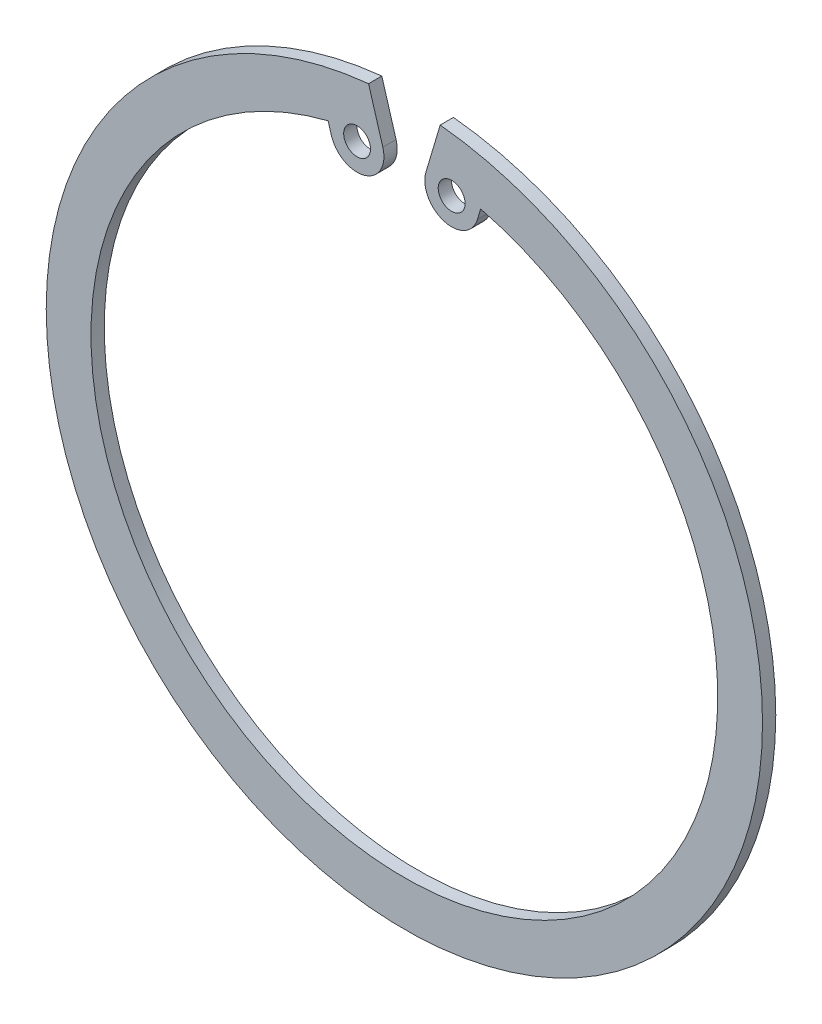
ISO-10303-21;
HEADER;
FILE_DESCRIPTION(('STEP AP214'),'2;1');
FILE_NAME('part.step','',(''),(''),'','','');
FILE_SCHEMA(('AUTOMOTIVE_DESIGN { 1 0 10303 214 1 1 1 1 }'));
ENDSEC;
DATA;
#1=APPLICATION_CONTEXT('core data for automotive mechanical design processes');
#2=APPLICATION_PROTOCOL_DEFINITION('international standard','automotive_design',2000,#1);
#3=PRODUCT_CONTEXT('',#1,'mechanical');
#4=PRODUCT('Part','Part','',(#3));
#5=PRODUCT_RELATED_PRODUCT_CATEGORY('part','',(#4));
#6=PRODUCT_DEFINITION_FORMATION('','',#4);
#7=PRODUCT_DEFINITION_CONTEXT('part definition',#1,'design');
#8=PRODUCT_DEFINITION('design','',#6,#7);
#9=PRODUCT_DEFINITION_SHAPE('','',#8);
#10=(LENGTH_UNIT() NAMED_UNIT(*) SI_UNIT(.MILLI.,.METRE.));
#11=(NAMED_UNIT(*) PLANE_ANGLE_UNIT() SI_UNIT($,.RADIAN.));
#12=(NAMED_UNIT(*) SI_UNIT($,.STERADIAN.) SOLID_ANGLE_UNIT());
#13=UNCERTAINTY_MEASURE_WITH_UNIT(LENGTH_MEASURE(1.E-05),#10,'distance_accuracy_value','');
#14=(GEOMETRIC_REPRESENTATION_CONTEXT(3) GLOBAL_UNCERTAINTY_ASSIGNED_CONTEXT((#13)) GLOBAL_UNIT_ASSIGNED_CONTEXT((#10,
#11,#12)) REPRESENTATION_CONTEXT('',''));
#15=CARTESIAN_POINT('',(0.,0.,0.));
#16=DIRECTION('',(0.,0.,1.));
#17=DIRECTION('',(1.,0.,0.));
#18=AXIS2_PLACEMENT_3D('',#15,#16,#17);
#19=CARTESIAN_POINT('',(5.28040556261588,33.587457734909,1.48));
#20=DIRECTION('',(0.,0.,-1.));
#21=DIRECTION('',(-1.,0.,0.));
#22=AXIS2_PLACEMENT_3D('',#19,#20,#21);
#23=PLANE('',#22);
#24=CARTESIAN_POINT('',(5.28040556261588,33.587457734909,1.48));
#25=DIRECTION('',(0.,0.,1.));
#26=DIRECTION('',(1.,0.,0.));
#27=AXIS2_PLACEMENT_3D('',#24,#25,#26);
#28=CIRCLE('',#27,1.5);
#29=CARTESIAN_POINT('',(6.78040556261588,33.587457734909,1.48));
#30=VERTEX_POINT('',#29);
#31=EDGE_CURVE('E120',#30,#30,#28,.T.);
#32=ORIENTED_EDGE('',*,*,#31,.F.);
#33=EDGE_LOOP('',(#32));
#34=FACE_BOUND('',#33,.T.);
#35=CARTESIAN_POINT('',(5.28040556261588,33.587457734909,1.48));
#36=DIRECTION('',(0.,0.,-1.));
#37=DIRECTION('',(-1.,0.,0.));
#38=AXIS2_PLACEMENT_3D('',#35,#36,#37);
#39=CIRCLE('',#38,3.);
#40=CARTESIAN_POINT('',(8.15564141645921,32.7312925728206,1.48));
#41=VERTEX_POINT('',#40);
#42=CARTESIAN_POINT('',(2.40516970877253,34.4436228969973,1.48));
#43=VERTEX_POINT('',#42);
#44=EDGE_CURVE('E101',#41,#43,#39,.T.);
#45=ORIENTED_EDGE('',*,*,#44,.F.);
#46=DIRECTION('',(-0.285388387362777,-0.958411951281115,0.));
#47=VECTOR('',#46,1.);
#48=CARTESIAN_POINT('',(8.51785299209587,33.9476977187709,1.48));
#49=LINE('',#48,#47);
#50=CARTESIAN_POINT('',(8.51785299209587,33.9476977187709,1.48));
#51=VERTEX_POINT('',#50);
#52=EDGE_CURVE('E106',#51,#41,#49,.T.);
#53=ORIENTED_EDGE('',*,*,#52,.F.);
#54=CARTESIAN_POINT('',(0.,0.,1.48));
#55=DIRECTION('',(0.,0.,1.));
#56=DIRECTION('',(1.,0.,0.));
#57=AXIS2_PLACEMENT_3D('',#54,#55,#56);
#58=CIRCLE('',#57,35.);
#59=CARTESIAN_POINT('',(-8.51785299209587,33.9476977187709,1.48));
#60=VERTEX_POINT('',#59);
#61=EDGE_CURVE('E148',#60,#51,#58,.T.);
#62=ORIENTED_EDGE('',*,*,#61,.F.);
#63=DIRECTION('',(0.285388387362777,-0.958411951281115,0.));
#64=VECTOR('',#63,1.);
#65=CARTESIAN_POINT('',(-8.51785299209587,33.9476977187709,1.48));
#66=LINE('',#65,#64);
#67=CARTESIAN_POINT('',(-8.15564141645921,32.7312925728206,1.48));
#68=VERTEX_POINT('',#67);
#69=EDGE_CURVE('E146',#60,#68,#66,.T.);
#70=ORIENTED_EDGE('',*,*,#69,.T.);
#71=CARTESIAN_POINT('',(-5.28040556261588,33.587457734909,1.48));
#72=DIRECTION('',(0.,0.,1.));
#73=DIRECTION('',(1.,0.,0.));
#74=AXIS2_PLACEMENT_3D('',#71,#72,#73);
#75=CIRCLE('',#74,3.);
#76=CARTESIAN_POINT('',(-2.40516970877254,34.4436228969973,1.48));
#77=VERTEX_POINT('',#76);
#78=EDGE_CURVE('E144',#68,#77,#75,.T.);
#79=ORIENTED_EDGE('',*,*,#78,.T.);
#80=DIRECTION('',(-0.285388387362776,0.958411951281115,0.));
#81=VECTOR('',#80,1.);
#82=CARTESIAN_POINT('',(-2.40516970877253,34.4436228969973,1.48));
#83=LINE('',#82,#81);
#84=CARTESIAN_POINT('',(-4.,39.7994974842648,1.48));
#85=VERTEX_POINT('',#84);
#86=EDGE_CURVE('E142',#77,#85,#83,.T.);
#87=ORIENTED_EDGE('',*,*,#86,.T.);
#88=CARTESIAN_POINT('',(0.,0.,1.48));
#89=DIRECTION('',(0.,0.,1.));
#90=DIRECTION('',(1.,0.,0.));
#91=AXIS2_PLACEMENT_3D('',#88,#89,#90);
#92=CIRCLE('',#91,40.);
#93=CARTESIAN_POINT('',(4.,39.7994974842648,1.48));
#94=VERTEX_POINT('',#93);
#95=EDGE_CURVE('E140',#85,#94,#92,.T.);
#96=ORIENTED_EDGE('',*,*,#95,.T.);
#97=DIRECTION('',(0.285388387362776,0.958411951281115,0.));
#98=VECTOR('',#97,1.);
#99=CARTESIAN_POINT('',(2.40516970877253,34.4436228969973,1.48));
#100=LINE('',#99,#98);
#101=EDGE_CURVE('E138',#43,#94,#100,.T.);
#102=ORIENTED_EDGE('',*,*,#101,.F.);
#103=EDGE_LOOP('',(#45,#53,#62,#70,#79,#87,#96,#102));
#104=FACE_BOUND('',#103,.T.);
#105=CARTESIAN_POINT('',(-5.28040556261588,33.587457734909,1.48));
#106=DIRECTION('',(0.,0.,1.));
#107=DIRECTION('',(1.,0.,0.));
#108=AXIS2_PLACEMENT_3D('',#105,#106,#107);
#109=CIRCLE('',#108,1.5);
#110=CARTESIAN_POINT('',(-3.78040556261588,33.587457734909,1.48));
#111=VERTEX_POINT('',#110);
#112=EDGE_CURVE('E217',#111,#111,#109,.T.);
#113=ORIENTED_EDGE('',*,*,#112,.F.);
#114=EDGE_LOOP('',(#113));
#115=FACE_BOUND('',#114,.T.);
#116=ADVANCED_FACE('F34',(#34,#104,#115),#23,.F.);
#117=CARTESIAN_POINT('',(5.28040556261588,33.587457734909,0.));
#118=DIRECTION('',(0.,0.,-1.));
#119=DIRECTION('',(-1.,0.,0.));
#120=AXIS2_PLACEMENT_3D('',#117,#118,#119);
#121=PLANE('',#120);
#122=CARTESIAN_POINT('',(5.28040556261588,33.587457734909,0.));
#123=DIRECTION('',(0.,0.,1.));
#124=DIRECTION('',(1.,0.,0.));
#125=AXIS2_PLACEMENT_3D('',#122,#123,#124);
#126=CIRCLE('',#125,1.5);
#127=CARTESIAN_POINT('',(6.78040556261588,33.587457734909,0.));
#128=VERTEX_POINT('',#127);
#129=EDGE_CURVE('E123',#128,#128,#126,.T.);
#130=ORIENTED_EDGE('',*,*,#129,.T.);
#131=EDGE_LOOP('',(#130));
#132=FACE_BOUND('',#131,.T.);
#133=CARTESIAN_POINT('',(5.28040556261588,33.587457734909,0.));
#134=DIRECTION('',(0.,0.,-1.));
#135=DIRECTION('',(-1.,0.,0.));
#136=AXIS2_PLACEMENT_3D('',#133,#134,#135);
#137=CIRCLE('',#136,3.);
#138=CARTESIAN_POINT('',(8.15564141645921,32.7312925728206,0.));
#139=VERTEX_POINT('',#138);
#140=CARTESIAN_POINT('',(2.40516970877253,34.4436228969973,0.));
#141=VERTEX_POINT('',#140);
#142=EDGE_CURVE('E99',#139,#141,#137,.T.);
#143=ORIENTED_EDGE('',*,*,#142,.T.);
#144=DIRECTION('',(0.285388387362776,0.958411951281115,0.));
#145=VECTOR('',#144,1.);
#146=CARTESIAN_POINT('',(2.40516970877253,34.4436228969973,0.));
#147=LINE('',#146,#145);
#148=CARTESIAN_POINT('',(4.,39.7994974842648,0.));
#149=VERTEX_POINT('',#148);
#150=EDGE_CURVE('E108',#141,#149,#147,.T.);
#151=ORIENTED_EDGE('',*,*,#150,.T.);
#152=CARTESIAN_POINT('',(0.,0.,0.));
#153=DIRECTION('',(0.,0.,1.));
#154=DIRECTION('',(1.,0.,0.));
#155=AXIS2_PLACEMENT_3D('',#152,#153,#154);
#156=CIRCLE('',#155,40.);
#157=CARTESIAN_POINT('',(-4.,39.7994974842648,0.));
#158=VERTEX_POINT('',#157);
#159=EDGE_CURVE('E114',#158,#149,#156,.T.);
#160=ORIENTED_EDGE('',*,*,#159,.F.);
#161=DIRECTION('',(-0.285388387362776,0.958411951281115,0.));
#162=VECTOR('',#161,1.);
#163=CARTESIAN_POINT('',(-2.40516970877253,34.4436228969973,0.));
#164=LINE('',#163,#162);
#165=CARTESIAN_POINT('',(-2.40516970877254,34.4436228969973,0.));
#166=VERTEX_POINT('',#165);
#167=EDGE_CURVE('E128',#166,#158,#164,.T.);
#168=ORIENTED_EDGE('',*,*,#167,.F.);
#169=CARTESIAN_POINT('',(-5.28040556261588,33.587457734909,0.));
#170=DIRECTION('',(0.,0.,1.));
#171=DIRECTION('',(1.,0.,0.));
#172=AXIS2_PLACEMENT_3D('',#169,#170,#171);
#173=CIRCLE('',#172,3.);
#174=CARTESIAN_POINT('',(-8.15564141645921,32.7312925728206,0.));
#175=VERTEX_POINT('',#174);
#176=EDGE_CURVE('E130',#175,#166,#173,.T.);
#177=ORIENTED_EDGE('',*,*,#176,.F.);
#178=DIRECTION('',(0.285388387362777,-0.958411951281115,0.));
#179=VECTOR('',#178,1.);
#180=CARTESIAN_POINT('',(-8.51785299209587,33.9476977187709,0.));
#181=LINE('',#180,#179);
#182=CARTESIAN_POINT('',(-8.51785299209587,33.9476977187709,0.));
#183=VERTEX_POINT('',#182);
#184=EDGE_CURVE('E132',#183,#175,#181,.T.);
#185=ORIENTED_EDGE('',*,*,#184,.F.);
#186=CARTESIAN_POINT('',(0.,0.,0.));
#187=DIRECTION('',(0.,0.,1.));
#188=DIRECTION('',(1.,0.,0.));
#189=AXIS2_PLACEMENT_3D('',#186,#187,#188);
#190=CIRCLE('',#189,35.);
#191=CARTESIAN_POINT('',(8.51785299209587,33.9476977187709,0.));
#192=VERTEX_POINT('',#191);
#193=EDGE_CURVE('E134',#183,#192,#190,.T.);
#194=ORIENTED_EDGE('',*,*,#193,.T.);
#195=DIRECTION('',(-0.285388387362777,-0.958411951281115,0.));
#196=VECTOR('',#195,1.);
#197=CARTESIAN_POINT('',(8.51785299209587,33.9476977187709,0.));
#198=LINE('',#197,#196);
#199=EDGE_CURVE('E119',#192,#139,#198,.T.);
#200=ORIENTED_EDGE('',*,*,#199,.T.);
#201=EDGE_LOOP('',(#143,#151,#160,#168,#177,#185,#194,#200));
#202=FACE_BOUND('',#201,.T.);
#203=CARTESIAN_POINT('',(-5.28040556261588,33.587457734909,0.));
#204=DIRECTION('',(0.,0.,1.));
#205=DIRECTION('',(1.,0.,0.));
#206=AXIS2_PLACEMENT_3D('',#203,#204,#205);
#207=CIRCLE('',#206,1.5);
#208=CARTESIAN_POINT('',(-3.78040556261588,33.587457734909,0.));
#209=VERTEX_POINT('',#208);
#210=EDGE_CURVE('E220',#209,#209,#207,.T.);
#211=ORIENTED_EDGE('',*,*,#210,.T.);
#212=EDGE_LOOP('',(#211));
#213=FACE_BOUND('',#212,.T.);
#214=ADVANCED_FACE('F116',(#132,#202,#213),#121,.T.);
#215=CARTESIAN_POINT('',(5.28040556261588,33.587457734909,1.48));
#216=DIRECTION('',(0.,0.,-1.));
#217=DIRECTION('',(-1.,0.,0.));
#218=AXIS2_PLACEMENT_3D('',#215,#216,#217);
#219=CYLINDRICAL_SURFACE('',#218,3.);
#220=ORIENTED_EDGE('',*,*,#142,.F.);
#221=DIRECTION('',(0.,0.,-1.));
#222=VECTOR('',#221,1.);
#223=CARTESIAN_POINT('',(8.15564141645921,32.7312925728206,1.48));
#224=LINE('',#223,#222);
#225=EDGE_CURVE('E11',#41,#139,#224,.T.);
#226=ORIENTED_EDGE('',*,*,#225,.F.);
#227=ORIENTED_EDGE('',*,*,#44,.T.);
#228=DIRECTION('',(0.,0.,-1.));
#229=VECTOR('',#228,1.);
#230=CARTESIAN_POINT('',(2.40516970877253,34.4436228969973,1.48));
#231=LINE('',#230,#229);
#232=EDGE_CURVE('E38',#43,#141,#231,.T.);
#233=ORIENTED_EDGE('',*,*,#232,.T.);
#234=EDGE_LOOP('',(#220,#226,#227,#233));
#235=FACE_BOUND('',#234,.T.);
#236=ADVANCED_FACE('F36',(#235),#219,.T.);
#237=CARTESIAN_POINT('',(8.51785299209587,33.9476977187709,1.48));
#238=DIRECTION('',(0.958411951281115,-0.285388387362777,0.));
#239=DIRECTION('',(0.285388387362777,0.958411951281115,0.));
#240=AXIS2_PLACEMENT_3D('',#237,#238,#239);
#241=PLANE('',#240);
#242=ORIENTED_EDGE('',*,*,#199,.F.);
#243=DIRECTION('',(0.,0.,-1.));
#244=VECTOR('',#243,1.);
#245=CARTESIAN_POINT('',(8.51785299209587,33.9476977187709,1.48));
#246=LINE('',#245,#244);
#247=EDGE_CURVE('E43',#51,#192,#246,.T.);
#248=ORIENTED_EDGE('',*,*,#247,.F.);
#249=ORIENTED_EDGE('',*,*,#52,.T.);
#250=ORIENTED_EDGE('',*,*,#225,.T.);
#251=EDGE_LOOP('',(#242,#248,#249,#250));
#252=FACE_BOUND('',#251,.T.);
#253=ADVANCED_FACE('F187',(#252),#241,.T.);
#254=CARTESIAN_POINT('',(0.,0.,1.48));
#255=DIRECTION('',(0.,0.,-1.));
#256=DIRECTION('',(-1.,0.,0.));
#257=AXIS2_PLACEMENT_3D('',#254,#255,#256);
#258=CYLINDRICAL_SURFACE('',#257,35.);
#259=ORIENTED_EDGE('',*,*,#193,.F.);
#260=DIRECTION('',(0.,0.,-1.));
#261=VECTOR('',#260,1.);
#262=CARTESIAN_POINT('',(-8.51785299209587,33.9476977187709,1.48));
#263=LINE('',#262,#261);
#264=EDGE_CURVE('E152',#60,#183,#263,.T.);
#265=ORIENTED_EDGE('',*,*,#264,.F.);
#266=ORIENTED_EDGE('',*,*,#61,.T.);
#267=ORIENTED_EDGE('',*,*,#247,.T.);
#268=EDGE_LOOP('',(#259,#265,#266,#267));
#269=FACE_BOUND('',#268,.T.);
#270=ADVANCED_FACE('F183',(#269),#258,.F.);
#271=CARTESIAN_POINT('',(-8.51785299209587,33.9476977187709,1.48));
#272=DIRECTION('',(0.958411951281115,0.285388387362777,0.));
#273=DIRECTION('',(-0.285388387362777,0.958411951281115,0.));
#274=AXIS2_PLACEMENT_3D('',#271,#272,#273);
#275=PLANE('',#274);
#276=ORIENTED_EDGE('',*,*,#184,.T.);
#277=DIRECTION('',(0.,0.,-1.));
#278=VECTOR('',#277,1.);
#279=CARTESIAN_POINT('',(-8.15564141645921,32.7312925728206,1.48));
#280=LINE('',#279,#278);
#281=EDGE_CURVE('E154',#68,#175,#280,.T.);
#282=ORIENTED_EDGE('',*,*,#281,.F.);
#283=ORIENTED_EDGE('',*,*,#69,.F.);
#284=ORIENTED_EDGE('',*,*,#264,.T.);
#285=EDGE_LOOP('',(#276,#282,#283,#284));
#286=FACE_BOUND('',#285,.T.);
#287=ADVANCED_FACE('F179',(#286),#275,.F.);
#288=CARTESIAN_POINT('',(-5.28040556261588,33.587457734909,1.48));
#289=DIRECTION('',(0.,0.,-1.));
#290=DIRECTION('',(-1.,0.,0.));
#291=AXIS2_PLACEMENT_3D('',#288,#289,#290);
#292=CYLINDRICAL_SURFACE('',#291,3.);
#293=ORIENTED_EDGE('',*,*,#176,.T.);
#294=DIRECTION('',(0.,0.,-1.));
#295=VECTOR('',#294,1.);
#296=CARTESIAN_POINT('',(-2.40516970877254,34.4436228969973,1.48));
#297=LINE('',#296,#295);
#298=EDGE_CURVE('E157',#77,#166,#297,.T.);
#299=ORIENTED_EDGE('',*,*,#298,.F.);
#300=ORIENTED_EDGE('',*,*,#78,.F.);
#301=ORIENTED_EDGE('',*,*,#281,.T.);
#302=EDGE_LOOP('',(#293,#299,#300,#301));
#303=FACE_BOUND('',#302,.T.);
#304=ADVANCED_FACE('F175',(#303),#292,.T.);
#305=CARTESIAN_POINT('',(-2.40516970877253,34.4436228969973,1.48));
#306=DIRECTION('',(-0.958411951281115,-0.285388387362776,0.));
#307=DIRECTION('',(0.285388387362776,-0.958411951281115,0.));
#308=AXIS2_PLACEMENT_3D('',#305,#306,#307);
#309=PLANE('',#308);
#310=ORIENTED_EDGE('',*,*,#167,.T.);
#311=DIRECTION('',(0.,0.,-1.));
#312=VECTOR('',#311,1.);
#313=CARTESIAN_POINT('',(-4.,39.7994974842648,1.48));
#314=LINE('',#313,#312);
#315=EDGE_CURVE('E160',#85,#158,#314,.T.);
#316=ORIENTED_EDGE('',*,*,#315,.F.);
#317=ORIENTED_EDGE('',*,*,#86,.F.);
#318=ORIENTED_EDGE('',*,*,#298,.T.);
#319=EDGE_LOOP('',(#310,#316,#317,#318));
#320=FACE_BOUND('',#319,.T.);
#321=ADVANCED_FACE('F171',(#320),#309,.F.);
#322=CARTESIAN_POINT('',(0.,0.,1.48));
#323=DIRECTION('',(0.,0.,-1.));
#324=DIRECTION('',(-1.,0.,0.));
#325=AXIS2_PLACEMENT_3D('',#322,#323,#324);
#326=CYLINDRICAL_SURFACE('',#325,40.);
#327=ORIENTED_EDGE('',*,*,#159,.T.);
#328=DIRECTION('',(0.,0.,-1.));
#329=VECTOR('',#328,1.);
#330=CARTESIAN_POINT('',(4.,39.7994974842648,1.48));
#331=LINE('',#330,#329);
#332=EDGE_CURVE('E105',#94,#149,#331,.T.);
#333=ORIENTED_EDGE('',*,*,#332,.F.);
#334=ORIENTED_EDGE('',*,*,#95,.F.);
#335=ORIENTED_EDGE('',*,*,#315,.T.);
#336=EDGE_LOOP('',(#327,#333,#334,#335));
#337=FACE_BOUND('',#336,.T.);
#338=ADVANCED_FACE('F165',(#337),#326,.T.);
#339=CARTESIAN_POINT('',(2.40516970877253,34.4436228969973,1.48));
#340=DIRECTION('',(-0.958411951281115,0.285388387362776,0.));
#341=DIRECTION('',(-0.285388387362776,-0.958411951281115,0.));
#342=AXIS2_PLACEMENT_3D('',#339,#340,#341);
#343=PLANE('',#342);
#344=ORIENTED_EDGE('',*,*,#150,.F.);
#345=ORIENTED_EDGE('',*,*,#232,.F.);
#346=ORIENTED_EDGE('',*,*,#101,.T.);
#347=ORIENTED_EDGE('',*,*,#332,.T.);
#348=EDGE_LOOP('',(#344,#345,#346,#347));
#349=FACE_BOUND('',#348,.T.);
#350=ADVANCED_FACE('F109',(#349),#343,.T.);
#351=CARTESIAN_POINT('',(5.28040556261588,33.587457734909,1.48));
#352=DIRECTION('',(0.,0.,-1.));
#353=DIRECTION('',(-1.,0.,0.));
#354=AXIS2_PLACEMENT_3D('',#351,#352,#353);
#355=CYLINDRICAL_SURFACE('',#354,1.5);
#356=ORIENTED_EDGE('',*,*,#31,.T.);
#357=EDGE_LOOP('',(#356));
#358=FACE_BOUND('',#357,.T.);
#359=ORIENTED_EDGE('',*,*,#129,.F.);
#360=EDGE_LOOP('',(#359));
#361=FACE_BOUND('',#360,.T.);
#362=ADVANCED_FACE('F205',(#358,#361),#355,.F.);
#363=CARTESIAN_POINT('',(-5.28040556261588,33.587457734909,1.48));
#364=DIRECTION('',(0.,0.,-1.));
#365=DIRECTION('',(-1.,0.,0.));
#366=AXIS2_PLACEMENT_3D('',#363,#364,#365);
#367=CYLINDRICAL_SURFACE('',#366,1.5);
#368=ORIENTED_EDGE('',*,*,#112,.T.);
#369=EDGE_LOOP('',(#368));
#370=FACE_BOUND('',#369,.T.);
#371=ORIENTED_EDGE('',*,*,#210,.F.);
#372=EDGE_LOOP('',(#371));
#373=FACE_BOUND('',#372,.T.);
#374=ADVANCED_FACE('F208',(#370,#373),#367,.F.);
#375=CLOSED_SHELL('',(#116,#214,#236,#253,#270,#287,#304,#321,#338,#350,#362,#374));
#376=MANIFOLD_SOLID_BREP('B2',#375);
#377=ADVANCED_BREP_SHAPE_REPRESENTATION('',(#18,#376),#14);
#378=SHAPE_DEFINITION_REPRESENTATION(#9,#377);
ENDSEC;
END-ISO-10303-21;
